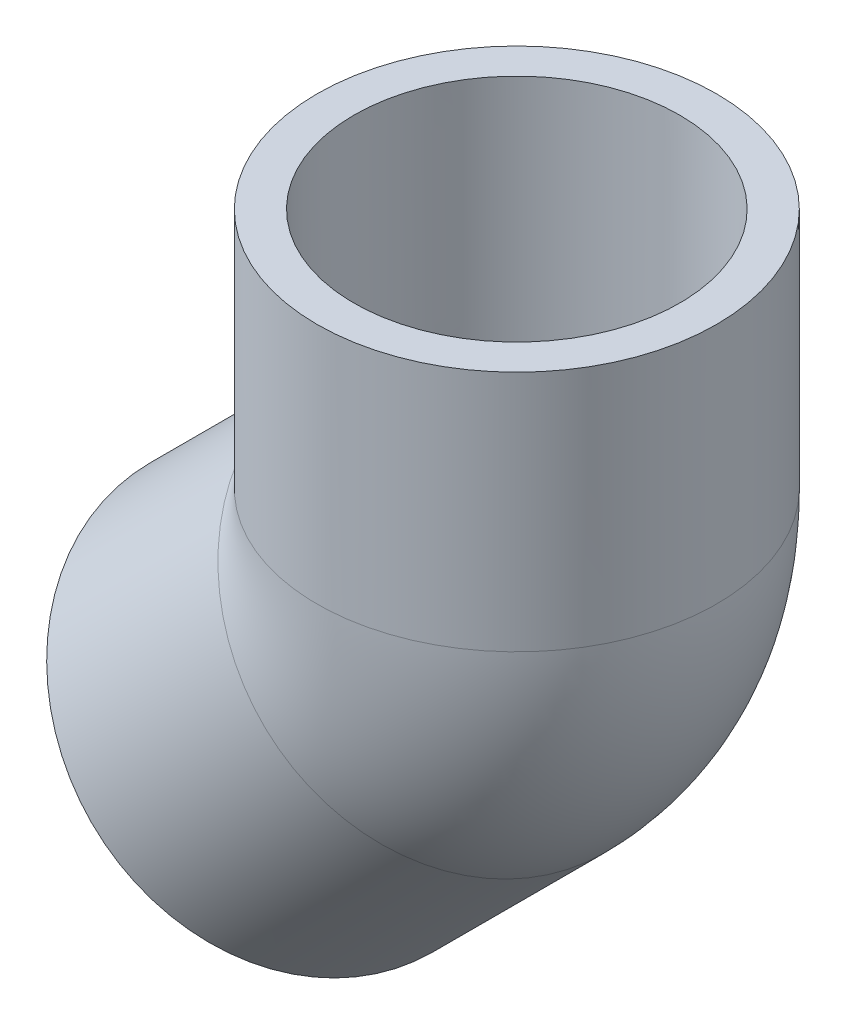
ISO-10303-21;
HEADER;
FILE_DESCRIPTION(('STEP AP214'),'2;1');
FILE_NAME('part.step','',(''),(''),'','','');
FILE_SCHEMA(('AUTOMOTIVE_DESIGN { 1 0 10303 214 1 1 1 1 }'));
ENDSEC;
DATA;
#1=APPLICATION_CONTEXT('core data for automotive mechanical design processes');
#2=APPLICATION_PROTOCOL_DEFINITION('international standard','automotive_design',2000,#1);
#3=PRODUCT_CONTEXT('',#1,'mechanical');
#4=PRODUCT('Part','Part','',(#3));
#5=PRODUCT_RELATED_PRODUCT_CATEGORY('part','',(#4));
#6=PRODUCT_DEFINITION_FORMATION('','',#4);
#7=PRODUCT_DEFINITION_CONTEXT('part definition',#1,'design');
#8=PRODUCT_DEFINITION('design','',#6,#7);
#9=PRODUCT_DEFINITION_SHAPE('','',#8);
#10=(LENGTH_UNIT() NAMED_UNIT(*) SI_UNIT(.MILLI.,.METRE.));
#11=(NAMED_UNIT(*) PLANE_ANGLE_UNIT() SI_UNIT($,.RADIAN.));
#12=(NAMED_UNIT(*) SI_UNIT($,.STERADIAN.) SOLID_ANGLE_UNIT());
#13=UNCERTAINTY_MEASURE_WITH_UNIT(LENGTH_MEASURE(1.E-05),#10,'distance_accuracy_value','');
#14=(GEOMETRIC_REPRESENTATION_CONTEXT(3) GLOBAL_UNCERTAINTY_ASSIGNED_CONTEXT((#13)) GLOBAL_UNIT_ASSIGNED_CONTEXT((#10,
#11,#12)) REPRESENTATION_CONTEXT('',''));
#15=CARTESIAN_POINT('',(0.,0.,0.));
#16=DIRECTION('',(0.,0.,1.));
#17=DIRECTION('',(1.,0.,0.));
#18=AXIS2_PLACEMENT_3D('',#15,#16,#17);
#19=CARTESIAN_POINT('',(-8.70186818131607,-37.8877005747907,0.));
#20=DIRECTION('',(-0.707106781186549,-0.707106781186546,0.));
#21=DIRECTION('',(0.707106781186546,-0.707106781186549,0.));
#22=AXIS2_PLACEMENT_3D('',#19,#20,#21);
#23=PLANE('',#22);
#24=CARTESIAN_POINT('',(-23.2947843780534,-23.2947843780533,0.));
#25=DIRECTION('',(-0.707106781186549,-0.707106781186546,0.));
#26=DIRECTION('',(0.707106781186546,-0.707106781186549,0.));
#27=AXIS2_PLACEMENT_3D('',#24,#25,#26);
#28=CIRCLE('',#27,20.6375);
#29=CARTESIAN_POINT('',(-8.70186818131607,-37.8877005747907,0.));
#30=VERTEX_POINT('',#29);
#31=EDGE_CURVE('E64',#30,#30,#28,.T.);
#32=ORIENTED_EDGE('',*,*,#31,.T.);
#33=EDGE_LOOP('',(#32));
#34=FACE_BOUND('',#33,.T.);
#35=CARTESIAN_POINT('',(-23.2947843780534,-23.2947843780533,0.));
#36=DIRECTION('',(-0.707106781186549,-0.707106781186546,0.));
#37=DIRECTION('',(0.707106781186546,-0.707106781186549,0.));
#38=AXIS2_PLACEMENT_3D('',#35,#36,#37);
#39=CIRCLE('',#38,16.8275);
#40=CARTESIAN_POINT('',(-11.3959450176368,-35.19362373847,0.));
#41=VERTEX_POINT('',#40);
#42=EDGE_CURVE('E44',#41,#41,#39,.T.);
#43=ORIENTED_EDGE('',*,*,#42,.F.);
#44=EDGE_LOOP('',(#43));
#45=FACE_BOUND('',#44,.T.);
#46=ADVANCED_FACE('F37',(#34,#45),#23,.T.);
#47=CARTESIAN_POINT('',(-5.60367981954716,-5.60367981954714,0.));
#48=DIRECTION('',(-0.707106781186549,-0.707106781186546,0.));
#49=DIRECTION('',(0.707106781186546,-0.707106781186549,0.));
#50=AXIS2_PLACEMENT_3D('',#47,#48,#49);
#51=CONICAL_SURFACE('',#50,16.637,0.00761406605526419);
#52=ORIENTED_EDGE('',*,*,#42,.T.);
#53=EDGE_LOOP('',(#52));
#54=FACE_BOUND('',#53,.T.);
#55=CARTESIAN_POINT('',(-5.60367981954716,-5.60367981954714,0.));
#56=DIRECTION('',(-0.707106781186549,-0.707106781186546,0.));
#57=DIRECTION('',(0.707106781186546,-0.707106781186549,0.));
#58=AXIS2_PLACEMENT_3D('',#55,#56,#57);
#59=CIRCLE('',#58,16.637);
#60=CARTESIAN_POINT('',(6.1604556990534,-17.3678153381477,0.));
#61=VERTEX_POINT('',#60);
#62=EDGE_CURVE('E82',#61,#61,#59,.T.);
#63=ORIENTED_EDGE('',*,*,#62,.F.);
#64=EDGE_LOOP('',(#63));
#65=FACE_BOUND('',#64,.T.);
#66=ADVANCED_FACE('F91',(#54,#65),#51,.F.);
#67=CARTESIAN_POINT('',(-23.2947843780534,-23.2947843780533,0.));
#68=DIRECTION('',(-0.707106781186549,-0.707106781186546,0.));
#69=DIRECTION('',(0.707106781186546,-0.707106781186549,0.));
#70=AXIS2_PLACEMENT_3D('',#67,#68,#69);
#71=CYLINDRICAL_SURFACE('',#70,20.6375);
#72=CARTESIAN_POINT('',(0.,0.,0.));
#73=DIRECTION('',(-0.382683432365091,-0.923879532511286,0.));
#74=DIRECTION('',(-0.923879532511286,0.382683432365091,0.));
#75=AXIS2_PLACEMENT_3D('',#72,#73,#74);
#76=ELLIPSE('',#75,22.3378690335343,20.6375);
#77=CARTESIAN_POINT('',(-19.1321596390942,7.92479999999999,-7.73736866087));
#78=VERTEX_POINT('',#77);
#79=CARTESIAN_POINT('',(-19.1321596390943,7.92479999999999,7.73736866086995));
#80=VERTEX_POINT('',#79);
#81=EDGE_CURVE('E58',#78,#80,#76,.F.);
#82=ORIENTED_EDGE('',*,*,#81,.F.);
#83=CARTESIAN_POINT('',(-5.60367981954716,-5.60367981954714,0.));
#84=DIRECTION('',(0.707106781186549,0.707106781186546,0.));
#85=DIRECTION('',(-0.707106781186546,0.707106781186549,0.));
#86=AXIS2_PLACEMENT_3D('',#83,#84,#85);
#87=CIRCLE('',#86,20.6375);
#88=EDGE_CURVE('E55',#80,#78,#87,.T.);
#89=ORIENTED_EDGE('',*,*,#88,.F.);
#90=EDGE_LOOP('',(#82,#89));
#91=FACE_BOUND('',#90,.T.);
#92=ORIENTED_EDGE('',*,*,#31,.F.);
#93=EDGE_LOOP('',(#92));
#94=FACE_BOUND('',#93,.T.);
#95=ADVANCED_FACE('F56',(#91,#94),#71,.T.);
#96=CARTESIAN_POINT('',(-5.60367981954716,-5.60367981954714,0.));
#97=DIRECTION('',(0.707106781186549,0.707106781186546,0.));
#98=DIRECTION('',(-0.707106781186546,0.707106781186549,0.));
#99=AXIS2_PLACEMENT_3D('',#96,#97,#98);
#100=PLANE('',#99);
#101=CARTESIAN_POINT('',(-5.60367981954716,-5.60367981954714,0.));
#102=DIRECTION('',(0.707106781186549,0.707106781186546,0.));
#103=DIRECTION('',(-0.707106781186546,0.707106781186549,0.));
#104=AXIS2_PLACEMENT_3D('',#101,#102,#103);
#105=CIRCLE('',#104,13.3223);
#106=CARTESIAN_POINT('',(3.81660885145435,-15.0239684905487,0.));
#107=VERTEX_POINT('',#106);
#108=EDGE_CURVE('E61',#107,#107,#105,.T.);
#109=ORIENTED_EDGE('',*,*,#108,.T.);
#110=EDGE_LOOP('',(#109));
#111=FACE_BOUND('',#110,.T.);
#112=ORIENTED_EDGE('',*,*,#62,.T.);
#113=EDGE_LOOP('',(#112));
#114=FACE_BOUND('',#113,.T.);
#115=ADVANCED_FACE('F101',(#111,#114),#100,.F.);
#116=CARTESIAN_POINT('',(-38.2643192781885,7.9248,0.));
#117=DIRECTION('',(0.,-1.,0.));
#118=DIRECTION('',(-1.,0.,0.));
#119=AXIS2_PLACEMENT_3D('',#116,#117,#118);
#120=CIRCLE('',#119,20.6375);
#121=TRIMMED_CURVE('',#120,(PARAMETER_VALUE(-2.75728441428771)),
(PARAMETER_VALUE(2.75728441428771)),.T.,.PARAMETER.);
#122=CARTESIAN_POINT('',(-19.1321596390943,7.9248,0.));
#123=DIRECTION('',(0.,0.,-1.));
#124=AXIS1_PLACEMENT('',#122,#123);
#125=SURFACE_OF_REVOLUTION('',#121,#124);
#126=ORIENTED_EDGE('',*,*,#88,.T.);
#127=CARTESIAN_POINT('',(0.,7.9248,0.));
#128=DIRECTION('',(0.,1.,0.));
#129=DIRECTION('',(-1.,0.,0.));
#130=AXIS2_PLACEMENT_3D('',#127,#128,#129);
#131=CIRCLE('',#130,20.6375);
#132=EDGE_CURVE('E50',#80,#78,#131,.T.);
#133=ORIENTED_EDGE('',*,*,#132,.F.);
#134=EDGE_LOOP('',(#126,#133));
#135=FACE_BOUND('',#134,.T.);
#136=ADVANCED_FACE('F63',(#135),#125,.T.);
#137=CARTESIAN_POINT('',(-19.1321596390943,7.9248,0.));
#138=DIRECTION('',(0.,0.,-1.));
#139=DIRECTION('',(-1.,0.,0.));
#140=AXIS2_PLACEMENT_3D('',#137,#138,#139);
#141=TOROIDAL_SURFACE('',#140,19.1321596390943,13.3223);
#142=CARTESIAN_POINT('',(0.,7.9248,0.));
#143=DIRECTION('',(0.,1.,0.));
#144=DIRECTION('',(-1.,0.,0.));
#145=AXIS2_PLACEMENT_3D('',#142,#143,#144);
#146=CIRCLE('',#145,13.3223);
#147=CARTESIAN_POINT('',(13.3223,7.9248,0.));
#148=VERTEX_POINT('',#147);
#149=EDGE_CURVE('E60',#148,#148,#146,.T.);
#150=CARTESIAN_POINT('',(-19.1321596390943,7.9248,0.));
#151=DIRECTION('',(0.,0.,-1.));
#152=DIRECTION('',(-1.,0.,0.));
#153=AXIS2_PLACEMENT_3D('',#150,#151,#152);
#154=CIRCLE('',#153,32.4544596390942);
#155=EDGE_CURVE('',#148,#107,#154,.T.);
#156=ORIENTED_EDGE('',*,*,#149,.T.);
#157=ORIENTED_EDGE('',*,*,#108,.F.);
#158=ORIENTED_EDGE('',*,*,#155,.T.);
#159=ORIENTED_EDGE('',*,*,#155,.F.);
#160=EDGE_LOOP('',(#156,#158,#157,#159));
#161=FACE_BOUND('',#160,.T.);
#162=ADVANCED_FACE('F111',(#161),#141,.F.);
#163=CARTESIAN_POINT('',(0.,7.9248,0.));
#164=DIRECTION('',(0.,1.,0.));
#165=DIRECTION('',(-1.,0.,0.));
#166=AXIS2_PLACEMENT_3D('',#163,#164,#165);
#167=PLANE('',#166);
#168=CARTESIAN_POINT('',(0.,7.9248,0.));
#169=DIRECTION('',(0.,1.,0.));
#170=DIRECTION('',(-1.,0.,0.));
#171=AXIS2_PLACEMENT_3D('',#168,#169,#170);
#172=CIRCLE('',#171,16.637);
#173=CARTESIAN_POINT('',(-16.637,7.92479999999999,0.));
#174=VERTEX_POINT('',#173);
#175=EDGE_CURVE('E11',#174,#174,#172,.F.);
#176=ORIENTED_EDGE('',*,*,#175,.F.);
#177=EDGE_LOOP('',(#176));
#178=FACE_BOUND('',#177,.T.);
#179=ORIENTED_EDGE('',*,*,#149,.F.);
#180=EDGE_LOOP('',(#179));
#181=FACE_BOUND('',#180,.T.);
#182=ADVANCED_FACE('F114',(#178,#181),#167,.T.);
#183=CARTESIAN_POINT('',(20.6375,32.9438,0.));
#184=DIRECTION('',(0.,1.,0.));
#185=DIRECTION('',(0.,0.,1.));
#186=AXIS2_PLACEMENT_3D('',#183,#184,#185);
#187=PLANE('',#186);
#188=CARTESIAN_POINT('',(0.,32.9438,0.));
#189=DIRECTION('',(0.,-1.,0.));
#190=DIRECTION('',(0.,0.,-1.));
#191=AXIS2_PLACEMENT_3D('',#188,#189,#190);
#192=CIRCLE('',#191,16.8275);
#193=CARTESIAN_POINT('',(0.,32.9438,-16.8275));
#194=VERTEX_POINT('',#193);
#195=EDGE_CURVE('E72',#194,#194,#192,.T.);
#196=ORIENTED_EDGE('',*,*,#195,.T.);
#197=EDGE_LOOP('',(#196));
#198=FACE_BOUND('',#197,.T.);
#199=CARTESIAN_POINT('',(0.,32.9438,0.));
#200=DIRECTION('',(0.,-1.,0.));
#201=DIRECTION('',(0.,0.,-1.));
#202=AXIS2_PLACEMENT_3D('',#199,#200,#201);
#203=CIRCLE('',#202,20.6375);
#204=CARTESIAN_POINT('',(0.,32.9438,-20.6375));
#205=VERTEX_POINT('',#204);
#206=EDGE_CURVE('E67',#205,#205,#203,.T.);
#207=ORIENTED_EDGE('',*,*,#206,.F.);
#208=EDGE_LOOP('',(#207));
#209=FACE_BOUND('',#208,.T.);
#210=ADVANCED_FACE('F117',(#198,#209),#187,.T.);
#211=CARTESIAN_POINT('',(0.,0.,0.));
#212=DIRECTION('',(0.,-1.,0.));
#213=DIRECTION('',(0.,0.,-1.));
#214=AXIS2_PLACEMENT_3D('',#211,#212,#213);
#215=CYLINDRICAL_SURFACE('',#214,20.6375);
#216=ORIENTED_EDGE('',*,*,#206,.T.);
#217=EDGE_LOOP('',(#216));
#218=FACE_BOUND('',#217,.T.);
#219=ORIENTED_EDGE('',*,*,#132,.T.);
#220=ORIENTED_EDGE('',*,*,#81,.T.);
#221=EDGE_LOOP('',(#219,#220));
#222=FACE_BOUND('',#221,.T.);
#223=ADVANCED_FACE('F66',(#218,#222),#215,.T.);
#224=CARTESIAN_POINT('',(0.,32.9438,0.));
#225=DIRECTION('',(0.,1.,0.));
#226=DIRECTION('',(0.,0.,1.));
#227=AXIS2_PLACEMENT_3D('',#224,#225,#226);
#228=CONICAL_SURFACE('',#227,16.8275,0.00761406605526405);
#229=ORIENTED_EDGE('',*,*,#175,.T.);
#230=EDGE_LOOP('',(#229));
#231=FACE_BOUND('',#230,.T.);
#232=ORIENTED_EDGE('',*,*,#195,.F.);
#233=EDGE_LOOP('',(#232));
#234=FACE_BOUND('',#233,.T.);
#235=ADVANCED_FACE('F125',(#231,#234),#228,.F.);
#236=CLOSED_SHELL('',(#46,#66,#95,#115,#136,#162,#182,#210,#223,#235));
#237=MANIFOLD_SOLID_BREP('B2',#236);
#238=ADVANCED_BREP_SHAPE_REPRESENTATION('',(#18,#237),#14);
#239=SHAPE_DEFINITION_REPRESENTATION(#9,#238);
ENDSEC;
END-ISO-10303-21;
